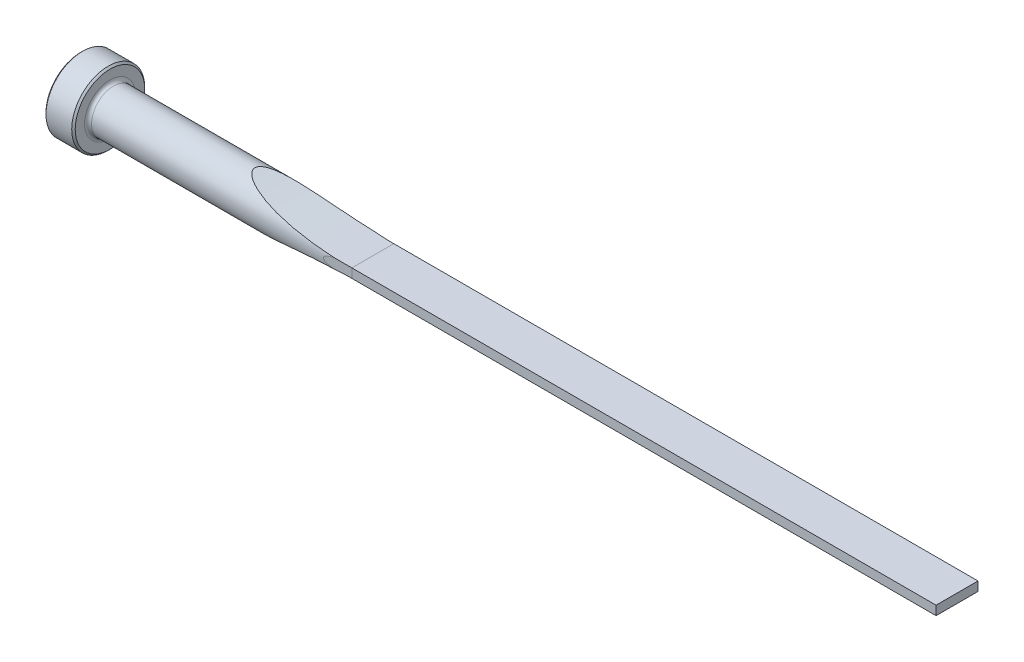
ISO-10303-21;
HEADER;
FILE_DESCRIPTION(('STEP AP214'),'2;1');
FILE_NAME('part.step','',(''),(''),'','','');
FILE_SCHEMA(('AUTOMOTIVE_DESIGN { 1 0 10303 214 1 1 1 1 }'));
ENDSEC;
DATA;
#1=APPLICATION_CONTEXT('core data for automotive mechanical design processes');
#2=APPLICATION_PROTOCOL_DEFINITION('international standard','automotive_design',2000,#1);
#3=PRODUCT_CONTEXT('',#1,'mechanical');
#4=PRODUCT('Part','Part','',(#3));
#5=PRODUCT_RELATED_PRODUCT_CATEGORY('part','',(#4));
#6=PRODUCT_DEFINITION_FORMATION('','',#4);
#7=PRODUCT_DEFINITION_CONTEXT('part definition',#1,'design');
#8=PRODUCT_DEFINITION('design','',#6,#7);
#9=PRODUCT_DEFINITION_SHAPE('','',#8);
#10=(LENGTH_UNIT() NAMED_UNIT(*) SI_UNIT(.MILLI.,.METRE.));
#11=(NAMED_UNIT(*) PLANE_ANGLE_UNIT() SI_UNIT($,.RADIAN.));
#12=(NAMED_UNIT(*) SI_UNIT($,.STERADIAN.) SOLID_ANGLE_UNIT());
#13=UNCERTAINTY_MEASURE_WITH_UNIT(LENGTH_MEASURE(1.E-05),#10,'distance_accuracy_value','');
#14=(GEOMETRIC_REPRESENTATION_CONTEXT(3) GLOBAL_UNCERTAINTY_ASSIGNED_CONTEXT((#13)) GLOBAL_UNIT_ASSIGNED_CONTEXT((#10,
#11,#12)) REPRESENTATION_CONTEXT('',''));
#15=CARTESIAN_POINT('',(0.,0.,0.));
#16=DIRECTION('',(0.,0.,1.));
#17=DIRECTION('',(1.,0.,0.));
#18=AXIS2_PLACEMENT_3D('',#15,#16,#17);
#19=CARTESIAN_POINT('',(0.,0.,0.));
#20=DIRECTION('',(-1.,0.,0.));
#21=DIRECTION('',(0.,0.,1.));
#22=AXIS2_PLACEMENT_3D('',#19,#20,#21);
#23=CYLINDRICAL_SURFACE('',#22,4.7625);
#24=CARTESIAN_POINT('',(7.112,0.,0.));
#25=DIRECTION('',(-1.,0.,0.));
#26=DIRECTION('',(0.,0.,1.));
#27=AXIS2_PLACEMENT_3D('',#24,#25,#26);
#28=CIRCLE('',#27,4.7625);
#29=CARTESIAN_POINT('',(7.112,0.,4.7625));
#30=VERTEX_POINT('',#29);
#31=EDGE_CURVE('E153',#30,#30,#28,.F.);
#32=ORIENTED_EDGE('',*,*,#31,.T.);
#33=EDGE_LOOP('',(#32));
#34=FACE_BOUND('',#33,.T.);
#35=CARTESIAN_POINT('',(63.5,1.37629566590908,4.55929999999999));
#36=CARTESIAN_POINT('',(63.300243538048,1.37627017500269,4.5592994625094));
#37=CARTESIAN_POINT('',(63.1004832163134,1.37406392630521,4.55997325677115));
#38=CARTESIAN_POINT('',(62.7010249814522,1.36511039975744,4.56266611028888));
#39=CARTESIAN_POINT('',(62.5013270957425,1.35836200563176,4.56468550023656));
#40=CARTESIAN_POINT('',(62.1003478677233,1.34006170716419,4.57009060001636));
#41=CARTESIAN_POINT('',(61.8990686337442,1.32846669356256,4.57348856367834));
#42=CARTESIAN_POINT('',(61.4969284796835,1.30007175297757,4.58164172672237));
#43=CARTESIAN_POINT('',(61.2960675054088,1.28327254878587,4.58639673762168));
#44=CARTESIAN_POINT('',(60.8961767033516,1.24395343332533,4.59721659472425));
#45=CARTESIAN_POINT('',(60.6971431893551,1.2214691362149,4.60327325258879));
#46=CARTESIAN_POINT('',(60.2999040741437,1.16973426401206,4.6166926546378));
#47=CARTESIAN_POINT('',(60.1016988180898,1.14048110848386,4.62405589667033));
#48=CARTESIAN_POINT('',(59.707485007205,1.07370926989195,4.640013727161));
#49=CARTESIAN_POINT('',(59.5114710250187,1.03622172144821,4.64860363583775));
#50=CARTESIAN_POINT('',(59.1219644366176,0.950234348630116,4.66695416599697));
#51=CARTESIAN_POINT('',(58.9284697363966,0.90174438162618,4.67671373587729));
#52=CARTESIAN_POINT('',(58.689568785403,0.8306098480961,4.68952997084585));
#53=CARTESIAN_POINT('',(58.6417966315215,0.815810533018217,4.69213189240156));
#54=CARTESIAN_POINT('',(58.5466454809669,0.784967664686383,4.69739068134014));
#55=CARTESIAN_POINT('',(58.4992665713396,0.768923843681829,4.70004756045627));
#56=CARTESIAN_POINT('',(58.3571752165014,0.718404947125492,4.70812874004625));
#57=CARTESIAN_POINT('',(58.2632340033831,0.681752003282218,4.71362458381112));
#58=CARTESIAN_POINT('',(58.0775344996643,0.599731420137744,4.72477713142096));
#59=CARTESIAN_POINT('',(57.985820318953,0.554256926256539,4.73043499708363));
#60=CARTESIAN_POINT('',(57.8546141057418,0.47603487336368,4.73871868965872));
#61=CARTESIAN_POINT('',(57.812099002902,0.448424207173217,4.74143547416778));
#62=CARTESIAN_POINT('',(57.7304247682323,0.388667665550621,4.74670987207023));
#63=CARTESIAN_POINT('',(57.6912549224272,0.356537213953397,4.74926798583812));
#64=CARTESIAN_POINT('',(57.634384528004,0.30109449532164,4.75301502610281));
#65=CARTESIAN_POINT('',(57.6146643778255,0.279884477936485,4.75432176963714));
#66=CARTESIAN_POINT('',(57.5781710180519,0.235020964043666,4.75675058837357));
#67=CARTESIAN_POINT('',(57.5613938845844,0.211370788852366,4.75787290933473));
#68=CARTESIAN_POINT('',(57.536135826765,0.168085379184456,4.75956809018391));
#69=CARTESIAN_POINT('',(57.5266352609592,0.149056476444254,4.76020769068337));
#70=CARTESIAN_POINT('',(57.5107840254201,0.109713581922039,4.76127659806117));
#71=CARTESIAN_POINT('',(57.5044294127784,0.0894012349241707,4.76170616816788));
#72=CARTESIAN_POINT('',(57.4955459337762,0.0476995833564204,4.76230708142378));
#73=CARTESIAN_POINT('',(57.4930580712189,0.0263011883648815,4.76247565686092));
#74=CARTESIAN_POINT('',(57.4924127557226,-0.0165581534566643,4.76251936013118));
#75=CARTESIAN_POINT('',(57.4942536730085,-0.038019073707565,4.76239459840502));
#76=CARTESIAN_POINT('',(57.5014223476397,-0.077150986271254,4.76190953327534));
#77=CARTESIAN_POINT('',(57.5062147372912,-0.0949256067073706,4.76158540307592));
#78=CARTESIAN_POINT('',(57.518318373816,-0.129583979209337,4.76076832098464));
#79=CARTESIAN_POINT('',(57.5256312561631,-0.146467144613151,4.76027525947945));
#80=CARTESIAN_POINT('',(57.5478239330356,-0.190109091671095,4.75878258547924));
#81=CARTESIAN_POINT('',(57.5644976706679,-0.215945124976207,4.75766444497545));
#82=CARTESIAN_POINT('',(57.6015159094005,-0.264813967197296,4.75519504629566));
#83=CARTESIAN_POINT('',(57.6218718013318,-0.287837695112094,4.75384306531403));
#84=CARTESIAN_POINT('',(57.6862463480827,-0.353109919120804,4.74959319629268));
#85=CARTESIAN_POINT('',(57.7337556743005,-0.391849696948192,4.7464888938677));
#86=CARTESIAN_POINT('',(57.8332528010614,-0.462955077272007,4.74007706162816));
#87=CARTESIAN_POINT('',(57.8852557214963,-0.495297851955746,4.73676885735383));
#88=CARTESIAN_POINT('',(58.0324605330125,-0.578484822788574,4.72754240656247));
#89=CARTESIAN_POINT('',(58.1303120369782,-0.624585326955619,4.7215611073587));
#90=CARTESIAN_POINT('',(58.3296567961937,-0.708279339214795,4.70972175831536));
#91=CARTESIAN_POINT('',(58.4311588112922,-0.745850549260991,4.70386406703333));
#92=CARTESIAN_POINT('',(58.637175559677,-0.815246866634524,4.69233729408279));
#93=CARTESIAN_POINT('',(58.7417096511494,-0.847014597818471,4.68667050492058));
#94=CARTESIAN_POINT('',(58.9519315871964,-0.905852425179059,4.67565197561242));
#95=CARTESIAN_POINT('',(59.0576177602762,-0.932928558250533,4.67029983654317));
#96=CARTESIAN_POINT('',(59.3472077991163,-1.0018017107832,4.6561580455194));
#97=CARTESIAN_POINT('',(59.5319939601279,-1.0399498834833,4.64770520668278));
#98=CARTESIAN_POINT('',(59.9031150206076,-1.10820041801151,4.63190013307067));
#99=CARTESIAN_POINT('',(60.0894504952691,-1.13829964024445,4.62454832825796));
#100=CARTESIAN_POINT('',(60.4634968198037,-1.19209136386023,4.61097562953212));
#101=CARTESIAN_POINT('',(60.6512097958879,-1.21576959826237,4.60475726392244));
#102=CARTESIAN_POINT('',(61.0272867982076,-1.25764094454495,4.59349611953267));
#103=CARTESIAN_POINT('',(61.2156508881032,-1.27583350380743,4.58845345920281));
#104=CARTESIAN_POINT('',(61.7534776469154,-1.32086317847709,4.57577149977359));
#105=CARTESIAN_POINT('',(62.1034775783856,-1.3418615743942,4.56957976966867));
#106=CARTESIAN_POINT('',(62.6280335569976,-1.36263417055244,4.56340533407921));
#107=CARTESIAN_POINT('',(62.8023917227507,-1.36777128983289,4.56186604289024));
#108=CARTESIAN_POINT('',(63.1511637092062,-1.37459791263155,4.55981341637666));
#109=CARTESIAN_POINT('',(63.3255775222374,-1.37628777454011,4.55929997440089));
#110=CARTESIAN_POINT('',(63.4999999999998,-1.37629566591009,4.55929999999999));
#111=B_SPLINE_CURVE_WITH_KNOTS('',3,(#35,#36,#37,#38,#39,#40,#41,#42,#43,#44,#45,#46,#47,#48,
#49,#50,#51,#52,#53,#54,#55,#56,#57,#58,#59,#60,#61,#62,#63,#64,#65,#66,#67,#68,#69,#70,#71,#72,
#73,#74,#75,#76,#77,#78,#79,#80,#81,#82,#83,#84,#85,#86,#87,#88,#89,#90,#91,#92,#93,#94,#95,#96,
#97,#98,#99,#100,#101,#102,#103,#104,#105,#106,#107,#108,#109,#110),.UNSPECIFIED.,.F.,.F.,(4,2,
2,2,2,2,2,2,2,2,2,2,2,2,2,2,2,2,2,2,2,2,2,2,2,2,2,2,2,2,2,2,2,2,2,2,2,4),(0.,0.599262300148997,
1.19867192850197,1.80353056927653,2.40830524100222,3.00938132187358,3.61068692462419,
4.2097569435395,4.80829234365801,4.95851786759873,5.10877580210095,5.41155733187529,
5.71826557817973,5.87039269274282,6.0220127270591,6.10881533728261,6.19550132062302,
6.25911958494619,6.32265791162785,6.38686552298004,6.45104896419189,6.50606849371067,
6.56112379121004,6.65289509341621,6.74495530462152,6.92807013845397,7.11182707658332,
7.43597686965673,7.76096456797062,8.08900931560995,8.41662876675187,8.98296372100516,
9.54951926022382,10.1173235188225,10.6851849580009,11.7368092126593,12.2601040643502,
12.7833445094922),.UNSPECIFIED.);
#112=CARTESIAN_POINT('',(59.7044690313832,1.0716608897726,4.64036088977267));
#113=VERTEX_POINT('',#112);
#114=CARTESIAN_POINT('',(59.7044690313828,-1.07166088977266,4.64036088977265));
#115=VERTEX_POINT('',#114);
#116=EDGE_CURVE('E156',#113,#115,#111,.T.);
#117=ORIENTED_EDGE('',*,*,#116,.F.);
#118=CARTESIAN_POINT('',(63.5,0.99059999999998,4.65833853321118));
#119=CARTESIAN_POINT('',(63.1029471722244,0.990599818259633,4.65832849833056));
#120=CARTESIAN_POINT('',(62.7058945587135,0.993260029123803,4.65777261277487));
#121=CARTESIAN_POINT('',(61.9118628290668,1.00389985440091,4.65549627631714));
#122=CARTESIAN_POINT('',(61.5148837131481,1.01187948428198,4.65377582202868));
#123=CARTESIAN_POINT('',(60.7210267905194,1.03315804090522,4.64909720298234));
#124=CARTESIAN_POINT('',(60.3241490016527,1.04645760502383,4.64613888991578));
#125=CARTESIAN_POINT('',(59.5306233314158,1.07837262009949,4.63883399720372));
#126=CARTESIAN_POINT('',(59.133975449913,1.09698806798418,4.63448741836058));
#127=CARTESIAN_POINT('',(57.9420256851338,1.16093510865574,4.61904976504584));
#128=CARTESIAN_POINT('',(57.1471666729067,1.21430184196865,4.6055729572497));
#129=CARTESIAN_POINT('',(55.559423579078,1.3423557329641,4.5698903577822));
#130=CARTESIAN_POINT('',(54.7665393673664,1.417041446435,4.54768515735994));
#131=CARTESIAN_POINT('',(53.2238153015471,1.58329126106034,4.49242798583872));
#132=CARTESIAN_POINT('',(52.4738418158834,1.67380073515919,4.45998672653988));
#133=CARTESIAN_POINT('',(51.3513459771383,1.82379135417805,4.3997791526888));
#134=CARTESIAN_POINT('',(50.9775513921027,1.87616568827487,4.37778269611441));
#135=CARTESIAN_POINT('',(50.2309518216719,1.98562465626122,4.32923747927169));
#136=CARTESIAN_POINT('',(49.8581468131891,2.04270917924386,4.30268882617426));
#137=CARTESIAN_POINT('',(49.1139213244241,2.16151329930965,4.24424854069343));
#138=CARTESIAN_POINT('',(48.7425001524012,2.22323011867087,4.21236009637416));
#139=CARTESIAN_POINT('',(48.0010599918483,2.35126953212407,4.14225407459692));
#140=CARTESIAN_POINT('',(47.6310409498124,2.41759194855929,4.10403674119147));
#141=CARTESIAN_POINT('',(46.892815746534,2.5547406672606,4.02009603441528));
#142=CARTESIAN_POINT('',(46.5246090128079,2.6255654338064,3.97437521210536));
#143=CARTESIAN_POINT('',(45.7903150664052,2.77161721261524,3.87393954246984));
#144=CARTESIAN_POINT('',(45.4242276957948,2.84684389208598,3.81922537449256));
#145=CARTESIAN_POINT('',(44.693840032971,3.00171663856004,3.69875073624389));
#146=CARTESIAN_POINT('',(44.3295462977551,3.08137306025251,3.63296358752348));
#147=CARTESIAN_POINT('',(43.6043732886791,3.24469913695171,3.48788156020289));
#148=CARTESIAN_POINT('',(43.2434951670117,3.32837009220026,3.40858228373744));
#149=CARTESIAN_POINT('',(42.7059558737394,3.45651123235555,3.27683661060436));
#150=CARTESIAN_POINT('',(42.5274060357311,3.49966399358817,3.23078867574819));
#151=CARTESIAN_POINT('',(42.1718343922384,3.58675976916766,3.13381840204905));
#152=CARTESIAN_POINT('',(41.9948124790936,3.63070272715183,3.08289640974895));
#153=CARTESIAN_POINT('',(41.6427504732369,3.71923835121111,2.9754854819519));
#154=CARTESIAN_POINT('',(41.4677091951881,3.76383058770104,2.91900009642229));
#155=CARTESIAN_POINT('',(41.1200080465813,3.85352553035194,2.79952338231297));
#156=CARTESIAN_POINT('',(40.9473478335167,3.89862816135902,2.73653300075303));
#157=CARTESIAN_POINT('',(40.6040909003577,3.9893832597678,2.60246513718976));
#158=CARTESIAN_POINT('',(40.4335120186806,4.0350373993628,2.53134275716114));
#159=CARTESIAN_POINT('',(40.096411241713,4.12631535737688,2.37965980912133));
#160=CARTESIAN_POINT('',(39.9298918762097,4.17193914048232,2.29909352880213));
#161=CARTESIAN_POINT('',(39.6027058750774,4.26257800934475,2.12634943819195));
#162=CARTESIAN_POINT('',(39.4420404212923,4.30759297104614,2.03416929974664));
#163=CARTESIAN_POINT('',(39.1296029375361,4.39603902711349,1.83525118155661));
#164=CARTESIAN_POINT('',(38.9778181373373,4.43947236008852,1.72853487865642));
#165=CARTESIAN_POINT('',(38.759696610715,4.50246697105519,1.55340678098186));
#166=CARTESIAN_POINT('',(38.688110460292,4.52324507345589,1.49203286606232));
#167=CARTESIAN_POINT('',(38.5497684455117,4.56357510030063,1.36371995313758));
#168=CARTESIAN_POINT('',(38.4830154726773,4.58312628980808,1.29677767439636));
#169=CARTESIAN_POINT('',(38.2932292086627,4.63893943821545,1.08738620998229));
#170=CARTESIAN_POINT('',(38.1790982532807,4.67281620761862,0.935192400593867));
#171=CARTESIAN_POINT('',(38.0476008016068,4.71203882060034,0.695441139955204));
#172=CARTESIAN_POINT('',(38.0116979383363,4.72278057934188,0.618934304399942));
#173=CARTESIAN_POINT('',(37.9515599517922,4.74080155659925,0.460990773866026));
#174=CARTESIAN_POINT('',(37.9273183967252,4.74808268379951,0.379556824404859));
#175=CARTESIAN_POINT('',(37.8927159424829,4.75848292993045,0.212756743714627));
#176=CARTESIAN_POINT('',(37.8824693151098,4.76156778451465,0.127364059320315));
#177=CARTESIAN_POINT('',(37.87748902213,4.76306661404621,-0.0439100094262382));
#178=CARTESIAN_POINT('',(37.8827506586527,4.76148200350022,-0.129791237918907));
#179=CARTESIAN_POINT('',(37.9069880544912,4.75419258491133,-0.291649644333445));
#180=CARTESIAN_POINT('',(37.9247267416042,4.74885946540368,-0.367837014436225));
#181=CARTESIAN_POINT('',(37.9709294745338,4.73499455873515,-0.516548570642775));
#182=CARTESIAN_POINT('',(37.999400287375,4.7264607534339,-0.58907041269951));
#183=CARTESIAN_POINT('',(38.0834016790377,4.70134396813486,-0.768755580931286));
#184=CARTESIAN_POINT('',(38.1451725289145,4.68292488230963,-0.872724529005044));
#185=CARTESIAN_POINT('',(38.2833081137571,4.64194220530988,-1.06956257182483));
#186=CARTESIAN_POINT('',(38.3597162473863,4.61936629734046,-1.16239728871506));
#187=CARTESIAN_POINT('',(38.5157382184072,4.57352818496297,-1.3308686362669));
#188=CARTESIAN_POINT('',(38.5945805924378,4.55047261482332,-1.40729062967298));
#189=CARTESIAN_POINT('',(38.7583123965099,4.50285981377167,-1.5529115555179));
#190=CARTESIAN_POINT('',(38.8432072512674,4.4783012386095,-1.62210386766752));
#191=CARTESIAN_POINT('',(39.0175838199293,4.42815473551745,-1.75438350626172));
#192=CARTESIAN_POINT('',(39.107074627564,4.40256479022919,-1.81745795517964));
#193=CARTESIAN_POINT('',(39.2893760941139,4.35075737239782,-1.93820126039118));
#194=CARTESIAN_POINT('',(39.3821855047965,4.32454013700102,-1.9958721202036));
#195=CARTESIAN_POINT('',(39.6196852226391,4.25788012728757,-2.13556036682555));
#196=CARTESIAN_POINT('',(39.7660990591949,4.2171756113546,-2.21451714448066));
#197=CARTESIAN_POINT('',(40.0632531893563,4.13540953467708,-2.36368625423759));
#198=CARTESIAN_POINT('',(40.2139956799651,4.09434780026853,-2.43389404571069));
#199=CARTESIAN_POINT('',(40.5189268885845,4.01216697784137,-2.56711016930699));
#200=CARTESIAN_POINT('',(40.673121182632,3.9710479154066,-2.63010567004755));
#201=CARTESIAN_POINT('',(40.9839744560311,3.88906255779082,-2.74988395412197));
#202=CARTESIAN_POINT('',(41.1406337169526,3.84819629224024,-2.80666602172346));
#203=CARTESIAN_POINT('',(41.4567086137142,3.76667717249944,-2.91516298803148));
#204=CARTESIAN_POINT('',(41.6161343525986,3.72602653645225,-2.96684997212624));
#205=CARTESIAN_POINT('',(41.9365715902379,3.64527630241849,-3.06552265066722));
#206=CARTESIAN_POINT('',(42.0975831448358,3.60517672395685,-3.11250817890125));
#207=CARTESIAN_POINT('',(42.4207194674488,3.52566739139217,-3.20229088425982));
#208=CARTESIAN_POINT('',(42.5828427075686,3.48625688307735,-3.245092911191));
#209=CARTESIAN_POINT('',(42.9081758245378,3.40814646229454,-3.32703212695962));
#210=CARTESIAN_POINT('',(43.0713856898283,3.36944654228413,-3.36616935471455));
#211=CARTESIAN_POINT('',(43.5400784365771,3.2597185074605,-3.47356496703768));
#212=CARTESIAN_POINT('',(43.8467111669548,3.1896329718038,-3.53778518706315));
#213=CARTESIAN_POINT('',(44.4624456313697,3.05235344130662,-3.65688163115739));
#214=CARTESIAN_POINT('',(44.7715477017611,2.98515984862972,-3.71175655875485));
#215=CARTESIAN_POINT('',(45.3918230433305,2.85380047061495,-3.81367813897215));
#216=CARTESIAN_POINT('',(45.7029971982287,2.78963608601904,-3.8607211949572));
#217=CARTESIAN_POINT('',(46.3269246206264,2.66447585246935,-3.9481383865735));
#218=CARTESIAN_POINT('',(46.6396779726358,2.60348017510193,-3.98851216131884));
#219=CARTESIAN_POINT('',(47.2671688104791,2.48460831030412,-4.06362920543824));
#220=CARTESIAN_POINT('',(47.5819091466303,2.42673927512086,-4.0983599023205));
#221=CARTESIAN_POINT('',(48.2124912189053,2.31432089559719,-4.16287326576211));
#222=CARTESIAN_POINT('',(48.5283329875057,2.2597716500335,-4.19265578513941));
#223=CARTESIAN_POINT('',(49.4770807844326,2.10119972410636,-4.27558958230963));
#224=CARTESIAN_POINT('',(50.1113976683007,2.00221715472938,-4.32234877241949));
#225=CARTESIAN_POINT('',(51.3827800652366,1.81792740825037,-4.40302345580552));
#226=CARTESIAN_POINT('',(52.0198455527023,1.73262010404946,-4.43693906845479));
#227=CARTESIAN_POINT('',(53.2961472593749,1.5757949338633,-4.49502683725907));
#228=CARTESIAN_POINT('',(53.9353836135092,1.50427794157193,-4.51919837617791));
#229=CARTESIAN_POINT('',(55.2147568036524,1.37519082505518,-4.56013445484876));
#230=CARTESIAN_POINT('',(55.8548917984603,1.31760498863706,-4.57690735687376));
#231=CARTESIAN_POINT('',(57.1363484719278,1.2163252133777,-4.60485841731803));
#232=CARTESIAN_POINT('',(57.7776700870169,1.17263055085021,-4.61603686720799));
#233=CARTESIAN_POINT('',(58.8429483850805,1.11165061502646,-4.63100940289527));
#234=CARTESIAN_POINT('',(59.2666682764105,1.09043731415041,-4.63602193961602));
#235=CARTESIAN_POINT('',(60.1144308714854,1.05407630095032,-4.64442451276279));
#236=CARTESIAN_POINT('',(60.5384736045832,1.03892922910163,-4.64781437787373));
#237=CARTESIAN_POINT('',(61.3854083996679,1.01474609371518,-4.65315560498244));
#238=CARTESIAN_POINT('',(61.8082998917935,1.00569098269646,-4.65511145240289));
#239=CARTESIAN_POINT('',(62.654127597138,0.993618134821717,-4.65769629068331));
#240=CARTESIAN_POINT('',(63.0770638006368,0.99059974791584,-4.65832542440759));
#241=CARTESIAN_POINT('',(63.5,0.990599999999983,-4.65833853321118));
#242=B_SPLINE_CURVE_WITH_KNOTS('',3,(#118,#119,#120,#121,#122,#123,#124,#125,#126,#127,#128,
#129,#130,#131,#132,#133,#134,#135,#136,#137,#138,#139,#140,#141,#142,#143,#144,#145,#146,#147,
#148,#149,#150,#151,#152,#153,#154,#155,#156,#157,#158,#159,#160,#161,#162,#163,#164,#165,#166,
#167,#168,#169,#170,#171,#172,#173,#174,#175,#176,#177,#178,#179,#180,#181,#182,#183,#184,#185,
#186,#187,#188,#189,#190,#191,#192,#193,#194,#195,#196,#197,#198,#199,#200,#201,#202,#203,#204,
#205,#206,#207,#208,#209,#210,#211,#212,#213,#214,#215,#216,#217,#218,#219,#220,#221,#222,#223,
#224,#225,#226,#227,#228,#229,#230,#231,#232,#233,#234,#235,#236,#237,#238,#239,#240,#241),
.UNSPECIFIED.,.F.,.F.,(4,2,2,2,2,2,2,2,2,2,2,2,2,2,2,2,2,2,2,2,2,2,2,2,2,2,2,2,2,2,2,2,2,2,2,2,
2,2,2,2,2,2,2,2,2,2,2,2,2,2,2,2,2,2,2,2,2,2,2,2,2,4),(0.,1.19114867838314,2.38230082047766,
3.57359571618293,4.76488992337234,7.15482549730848,9.5445992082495,11.8125362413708,
12.9467485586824,14.0809341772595,15.2144450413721,16.3479122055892,17.4809948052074,
18.6139918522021,19.7497587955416,20.8858961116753,21.4539629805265,22.0219894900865,
22.5896558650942,23.157239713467,23.7281241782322,24.2993557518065,24.8707020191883,
25.4412054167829,25.7305810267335,26.0201283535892,26.5932280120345,26.8480141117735,
27.1026595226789,27.359371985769,27.6160066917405,27.8502419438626,28.084625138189,
28.449508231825,28.8154904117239,29.1515825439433,29.487979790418,29.8250704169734,
30.1620355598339,30.6754130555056,31.1890558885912,31.7035987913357,32.2182009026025,
32.7354816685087,33.2527807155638,33.7694727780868,34.2861593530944,35.2490357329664,
36.2120455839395,37.1754964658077,38.1389994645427,39.1046205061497,40.0702702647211,
42.000991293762,43.9316943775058,45.8625197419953,47.7911571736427,49.7196941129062,
50.9924924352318,52.2654251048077,53.5343590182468,54.8031562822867),.UNSPECIFIED.);
#243=CARTESIAN_POINT('',(59.7044690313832,1.0716608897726,-4.64036088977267));
#244=VERTEX_POINT('',#243);
#245=EDGE_CURVE('E106',#113,#244,#242,.T.);
#246=ORIENTED_EDGE('',*,*,#245,.T.);
#247=CARTESIAN_POINT('',(63.5,1.37629566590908,-4.55929999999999));
#248=CARTESIAN_POINT('',(63.3002435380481,1.37627017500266,-4.55929946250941));
#249=CARTESIAN_POINT('',(63.1004832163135,1.37406392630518,-4.55997325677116));
#250=CARTESIAN_POINT('',(62.7010249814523,1.36511039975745,-4.56266611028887));
#251=CARTESIAN_POINT('',(62.5013270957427,1.3583620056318,-4.56468550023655));
#252=CARTESIAN_POINT('',(62.1003478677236,1.34006170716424,-4.57009060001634));
#253=CARTESIAN_POINT('',(61.8990686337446,1.32846669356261,-4.57348856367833));
#254=CARTESIAN_POINT('',(61.4969284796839,1.3000717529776,-4.58164172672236));
#255=CARTESIAN_POINT('',(61.2960675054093,1.2832725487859,-4.58639673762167));
#256=CARTESIAN_POINT('',(60.8961767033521,1.24395343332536,-4.59721659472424));
#257=CARTESIAN_POINT('',(60.6971431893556,1.22146913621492,-4.60327325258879));
#258=CARTESIAN_POINT('',(60.299904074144,1.16973426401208,-4.6166926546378));
#259=CARTESIAN_POINT('',(60.1016988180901,1.14048110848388,-4.62405589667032));
#260=CARTESIAN_POINT('',(59.7074850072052,1.07370926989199,-4.64001372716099));
#261=CARTESIAN_POINT('',(59.5114710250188,1.03622172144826,-4.64860363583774));
#262=CARTESIAN_POINT('',(59.1219644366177,0.950234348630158,-4.66695416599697));
#263=CARTESIAN_POINT('',(58.9284697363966,0.901744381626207,-4.67671373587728));
#264=CARTESIAN_POINT('',(58.689568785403,0.830609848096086,-4.68952997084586));
#265=CARTESIAN_POINT('',(58.6417966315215,0.815810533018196,-4.69213189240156));
#266=CARTESIAN_POINT('',(58.5466454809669,0.784967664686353,-4.69739068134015));
#267=CARTESIAN_POINT('',(58.4992665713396,0.768923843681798,-4.70004756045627));
#268=CARTESIAN_POINT('',(58.3571752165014,0.718404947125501,-4.70812874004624));
#269=CARTESIAN_POINT('',(58.263234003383,0.681752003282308,-4.7136245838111));
#270=CARTESIAN_POINT('',(58.0775344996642,0.599731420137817,-4.72477713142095));
#271=CARTESIAN_POINT('',(57.985820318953,0.554256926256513,-4.73043499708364));
#272=CARTESIAN_POINT('',(57.8546141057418,0.476034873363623,-4.73871868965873));
#273=CARTESIAN_POINT('',(57.812099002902,0.448424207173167,-4.74143547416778));
#274=CARTESIAN_POINT('',(57.7304247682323,0.388667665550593,-4.74670987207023));
#275=CARTESIAN_POINT('',(57.6912549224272,0.356537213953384,-4.74926798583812));
#276=CARTESIAN_POINT('',(57.634384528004,0.301094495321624,-4.75301502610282));
#277=CARTESIAN_POINT('',(57.6146643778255,0.279884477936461,-4.75432176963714));
#278=CARTESIAN_POINT('',(57.5781710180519,0.235020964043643,-4.75675058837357));
#279=CARTESIAN_POINT('',(57.5613938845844,0.211370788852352,-4.75787290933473));
#280=CARTESIAN_POINT('',(57.536135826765,0.168085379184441,-4.75956809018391));
#281=CARTESIAN_POINT('',(57.5266352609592,0.149056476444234,-4.76020769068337));
#282=CARTESIAN_POINT('',(57.5107840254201,0.109713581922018,-4.76127659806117));
#283=CARTESIAN_POINT('',(57.5044294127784,0.0894012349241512,-4.76170616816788));
#284=CARTESIAN_POINT('',(57.4955459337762,0.0476995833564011,-4.76230708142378));
#285=CARTESIAN_POINT('',(57.4930580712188,0.0263011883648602,-4.76247565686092));
#286=CARTESIAN_POINT('',(57.4924127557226,-0.0165581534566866,-4.76251936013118));
#287=CARTESIAN_POINT('',(57.4942536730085,-0.0380190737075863,-4.76239459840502));
#288=CARTESIAN_POINT('',(57.5014223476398,-0.0771509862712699,-4.76190953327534));
#289=CARTESIAN_POINT('',(57.5062147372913,-0.0949256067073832,-4.76158540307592));
#290=CARTESIAN_POINT('',(57.5183183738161,-0.129583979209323,-4.76076832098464));
#291=CARTESIAN_POINT('',(57.5256312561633,-0.146467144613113,-4.76027525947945));
#292=CARTESIAN_POINT('',(57.5478239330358,-0.190109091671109,-4.75878258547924));
#293=CARTESIAN_POINT('',(57.5644976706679,-0.215945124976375,-4.75766444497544));
#294=CARTESIAN_POINT('',(57.6015159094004,-0.264813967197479,-4.75519504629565));
#295=CARTESIAN_POINT('',(57.6218718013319,-0.287837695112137,-4.75384306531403));
#296=CARTESIAN_POINT('',(57.686246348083,-0.353109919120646,-4.74959319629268));
#297=CARTESIAN_POINT('',(57.7337556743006,-0.391849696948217,-4.74648889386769));
#298=CARTESIAN_POINT('',(57.8332528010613,-0.462955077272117,-4.74007706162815));
#299=CARTESIAN_POINT('',(57.8852557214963,-0.495297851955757,-4.73676885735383));
#300=CARTESIAN_POINT('',(58.0324605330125,-0.578484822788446,-4.72754240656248));
#301=CARTESIAN_POINT('',(58.1303120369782,-0.624585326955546,-4.72156110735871));
#302=CARTESIAN_POINT('',(58.3296567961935,-0.708279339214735,-4.70972175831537));
#303=CARTESIAN_POINT('',(58.431158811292,-0.74585054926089,-4.70386406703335));
#304=CARTESIAN_POINT('',(58.6371755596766,-0.815246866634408,-4.69233729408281));
#305=CARTESIAN_POINT('',(58.741709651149,-0.847014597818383,-4.6866705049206));
#306=CARTESIAN_POINT('',(58.9519315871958,-0.90585242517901,-4.67565197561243));
#307=CARTESIAN_POINT('',(59.0576177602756,-0.932928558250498,-4.67029983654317));
#308=CARTESIAN_POINT('',(59.3472077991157,-1.00180171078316,-4.65615804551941));
#309=CARTESIAN_POINT('',(59.5319939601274,-1.03994988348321,-4.6477052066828));
#310=CARTESIAN_POINT('',(59.9031150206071,-1.10820041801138,-4.63190013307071));
#311=CARTESIAN_POINT('',(60.0894504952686,-1.13829964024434,-4.62454832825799));
#312=CARTESIAN_POINT('',(60.4634968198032,-1.19209136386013,-4.61097562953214));
#313=CARTESIAN_POINT('',(60.6512097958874,-1.21576959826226,-4.60475726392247));
#314=CARTESIAN_POINT('',(61.0272867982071,-1.25764094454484,-4.5934961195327));
#315=CARTESIAN_POINT('',(61.2156508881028,-1.27583350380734,-4.58845345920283));
#316=CARTESIAN_POINT('',(61.753477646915,-1.32086317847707,-4.5757714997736));
#317=CARTESIAN_POINT('',(62.1034775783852,-1.34186157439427,-4.56957976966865));
#318=CARTESIAN_POINT('',(62.6280335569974,-1.36263417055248,-4.5634053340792));
#319=CARTESIAN_POINT('',(62.8023917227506,-1.36777128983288,-4.56186604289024));
#320=CARTESIAN_POINT('',(63.1511637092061,-1.3745979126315,-4.55981341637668));
#321=CARTESIAN_POINT('',(63.3255775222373,-1.37628777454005,-4.5592999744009));
#322=CARTESIAN_POINT('',(63.4999999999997,-1.3762956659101,-4.55929999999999));
#323=B_SPLINE_CURVE_WITH_KNOTS('',3,(#247,#248,#249,#250,#251,#252,#253,#254,#255,#256,#257,
#258,#259,#260,#261,#262,#263,#264,#265,#266,#267,#268,#269,#270,#271,#272,#273,#274,#275,#276,
#277,#278,#279,#280,#281,#282,#283,#284,#285,#286,#287,#288,#289,#290,#291,#292,#293,#294,#295,
#296,#297,#298,#299,#300,#301,#302,#303,#304,#305,#306,#307,#308,#309,#310,#311,#312,#313,#314,
#315,#316,#317,#318,#319,#320,#321,#322),.UNSPECIFIED.,.F.,.F.,(4,2,2,2,2,2,2,2,2,2,2,2,2,2,2,2,
2,2,2,2,2,2,2,2,2,2,2,2,2,2,2,2,2,2,2,2,2,4),(0.,0.599262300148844,1.19867192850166,
1.80353056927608,2.40830524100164,3.00938132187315,3.61068692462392,4.20975694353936,
4.80829234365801,4.95851786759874,5.10877580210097,5.41155733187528,5.71826557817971,
5.87039269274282,6.0220127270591,6.10881533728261,6.19550132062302,6.25911958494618,
6.32265791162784,6.38686552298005,6.45104896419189,6.50606849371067,6.56112379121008,
6.65289509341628,6.7449553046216,6.92807013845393,7.1118270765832,7.43597686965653,
7.76096456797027,8.08900931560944,8.41662876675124,8.98296372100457,9.54951926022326,
10.1173235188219,10.6851849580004,11.7368092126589,12.26010406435,12.7833445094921),.UNSPECIFIED.);
#324=CARTESIAN_POINT('',(59.7044690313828,-1.07166088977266,-4.64036088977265));
#325=VERTEX_POINT('',#324);
#326=EDGE_CURVE('E175',#244,#325,#323,.T.);
#327=ORIENTED_EDGE('',*,*,#326,.T.);
#328=CARTESIAN_POINT('',(63.5,-0.99059999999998,4.65833853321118));
#329=CARTESIAN_POINT('',(63.1029471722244,-0.990599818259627,4.65832849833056));
#330=CARTESIAN_POINT('',(62.7058945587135,-0.993260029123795,4.65777261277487));
#331=CARTESIAN_POINT('',(61.9118628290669,-1.0038998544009,4.65549627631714));
#332=CARTESIAN_POINT('',(61.5148837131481,-1.01187948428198,4.65377582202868));
#333=CARTESIAN_POINT('',(60.7210267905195,-1.03315804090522,4.64909720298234));
#334=CARTESIAN_POINT('',(60.3241490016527,-1.04645760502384,4.64613888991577));
#335=CARTESIAN_POINT('',(59.5306233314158,-1.07837262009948,4.63883399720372));
#336=CARTESIAN_POINT('',(59.133975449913,-1.09698806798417,4.63448741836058));
#337=CARTESIAN_POINT('',(57.9420256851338,-1.16093510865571,4.61904976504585));
#338=CARTESIAN_POINT('',(57.1471666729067,-1.21430184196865,4.6055729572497));
#339=CARTESIAN_POINT('',(55.5594235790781,-1.34235573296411,4.5698903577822));
#340=CARTESIAN_POINT('',(54.7665393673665,-1.417041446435,4.54768515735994));
#341=CARTESIAN_POINT('',(53.2238153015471,-1.58329126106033,4.49242798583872));
#342=CARTESIAN_POINT('',(52.4738418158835,-1.6738007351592,4.45998672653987));
#343=CARTESIAN_POINT('',(51.3513459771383,-1.82379135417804,4.3997791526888));
#344=CARTESIAN_POINT('',(50.9775513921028,-1.87616568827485,4.37778269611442));
#345=CARTESIAN_POINT('',(50.230951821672,-1.98562465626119,4.3292374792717));
#346=CARTESIAN_POINT('',(49.8581468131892,-2.04270917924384,4.30268882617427));
#347=CARTESIAN_POINT('',(49.1139213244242,-2.16151329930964,4.24424854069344));
#348=CARTESIAN_POINT('',(48.7425001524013,-2.22323011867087,4.21236009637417));
#349=CARTESIAN_POINT('',(48.0010599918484,-2.35126953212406,4.14225407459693));
#350=CARTESIAN_POINT('',(47.6310409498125,-2.41759194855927,4.10403674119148));
#351=CARTESIAN_POINT('',(46.892815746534,-2.55474066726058,4.02009603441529));
#352=CARTESIAN_POINT('',(46.5246090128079,-2.62556543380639,3.97437521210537));
#353=CARTESIAN_POINT('',(45.7903150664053,-2.77161721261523,3.87393954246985));
#354=CARTESIAN_POINT('',(45.4242276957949,-2.84684389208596,3.81922537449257));
#355=CARTESIAN_POINT('',(44.693840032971,-3.00171663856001,3.69875073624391));
#356=CARTESIAN_POINT('',(44.3295462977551,-3.08137306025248,3.6329635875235));
#357=CARTESIAN_POINT('',(43.6043732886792,-3.2446991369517,3.48788156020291));
#358=CARTESIAN_POINT('',(43.2434951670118,-3.32837009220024,3.40858228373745));
#359=CARTESIAN_POINT('',(42.7059558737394,-3.45651123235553,3.27683661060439));
#360=CARTESIAN_POINT('',(42.5274060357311,-3.49966399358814,3.23078867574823));
#361=CARTESIAN_POINT('',(42.1718343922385,-3.58675976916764,3.13381840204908));
#362=CARTESIAN_POINT('',(41.9948124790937,-3.63070272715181,3.08289640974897));
#363=CARTESIAN_POINT('',(41.6427504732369,-3.7192383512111,2.97548548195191));
#364=CARTESIAN_POINT('',(41.4677091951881,-3.76383058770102,2.91900009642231));
#365=CARTESIAN_POINT('',(41.1200080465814,-3.85352553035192,2.799523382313));
#366=CARTESIAN_POINT('',(40.9473478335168,-3.89862816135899,2.73653300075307));
#367=CARTESIAN_POINT('',(40.6040909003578,-3.98938325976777,2.60246513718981));
#368=CARTESIAN_POINT('',(40.4335120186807,-4.03503739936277,2.53134275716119));
#369=CARTESIAN_POINT('',(40.0964112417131,-4.12631535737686,2.37965980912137));
#370=CARTESIAN_POINT('',(39.9298918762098,-4.1719391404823,2.29909352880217));
#371=CARTESIAN_POINT('',(39.6027058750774,-4.26257800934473,2.12634943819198));
#372=CARTESIAN_POINT('',(39.4420404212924,-4.30759297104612,2.03416929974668));
#373=CARTESIAN_POINT('',(39.1296029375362,-4.39603902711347,1.83525118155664));
#374=CARTESIAN_POINT('',(38.9778181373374,-4.43947236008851,1.72853487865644));
#375=CARTESIAN_POINT('',(38.759696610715,-4.50246697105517,1.55340678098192));
#376=CARTESIAN_POINT('',(38.6881104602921,-4.52324507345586,1.4920328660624));
#377=CARTESIAN_POINT('',(38.5497684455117,-4.5635751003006,1.36371995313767));
#378=CARTESIAN_POINT('',(38.4830154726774,-4.58312628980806,1.29677767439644));
#379=CARTESIAN_POINT('',(38.2932292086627,-4.63893943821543,1.08738620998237));
#380=CARTESIAN_POINT('',(38.1790982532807,-4.6728162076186,0.935192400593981));
#381=CARTESIAN_POINT('',(38.0476008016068,-4.71203882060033,0.695441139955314));
#382=CARTESIAN_POINT('',(38.0116979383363,-4.72278057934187,0.618934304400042));
#383=CARTESIAN_POINT('',(37.9515599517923,-4.74080155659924,0.460990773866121));
#384=CARTESIAN_POINT('',(37.9273183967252,-4.7480826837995,0.379556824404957));
#385=CARTESIAN_POINT('',(37.8927159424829,-4.75848292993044,0.212756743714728));
#386=CARTESIAN_POINT('',(37.8824693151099,-4.76156778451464,0.127364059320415));
#387=CARTESIAN_POINT('',(37.87748902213,-4.76306661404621,-0.0439100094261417));
#388=CARTESIAN_POINT('',(37.8827506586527,-4.76148200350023,-0.129791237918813));
#389=CARTESIAN_POINT('',(37.9069880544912,-4.75419258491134,-0.291649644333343));
#390=CARTESIAN_POINT('',(37.9247267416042,-4.74885946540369,-0.367837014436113));
#391=CARTESIAN_POINT('',(37.9709294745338,-4.73499455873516,-0.51654857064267));
#392=CARTESIAN_POINT('',(37.999400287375,-4.72646075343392,-0.589070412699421));
#393=CARTESIAN_POINT('',(38.0834016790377,-4.70134396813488,-0.7687555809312));
#394=CARTESIAN_POINT('',(38.1451725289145,-4.68292488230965,-0.87272452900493));
#395=CARTESIAN_POINT('',(38.283308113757,-4.64194220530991,-1.06956257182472));
#396=CARTESIAN_POINT('',(38.3597162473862,-4.61936629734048,-1.16239728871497));
#397=CARTESIAN_POINT('',(38.5157382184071,-4.573528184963,-1.33086863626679));
#398=CARTESIAN_POINT('',(38.5945805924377,-4.55047261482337,-1.40729062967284));
#399=CARTESIAN_POINT('',(38.7583123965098,-4.50285981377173,-1.55291155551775));
#400=CARTESIAN_POINT('',(38.8432072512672,-4.47830123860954,-1.6221038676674));
#401=CARTESIAN_POINT('',(39.0175838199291,-4.4281547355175,-1.75438350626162));
#402=CARTESIAN_POINT('',(39.1070746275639,-4.40256479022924,-1.81745795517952));
#403=CARTESIAN_POINT('',(39.2893760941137,-4.35075737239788,-1.93820126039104));
#404=CARTESIAN_POINT('',(39.3821855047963,-4.32454013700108,-1.99587212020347));
#405=CARTESIAN_POINT('',(39.6196852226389,-4.25788012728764,-2.13556036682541));
#406=CARTESIAN_POINT('',(39.7660990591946,-4.21717561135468,-2.21451714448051));
#407=CARTESIAN_POINT('',(40.063253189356,-4.13540953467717,-2.36368625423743));
#408=CARTESIAN_POINT('',(40.2139956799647,-4.09434780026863,-2.43389404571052));
#409=CARTESIAN_POINT('',(40.5189268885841,-4.01216697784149,-2.56711016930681));
#410=CARTESIAN_POINT('',(40.6731211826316,-3.97104791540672,-2.63010567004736));
#411=CARTESIAN_POINT('',(40.9839744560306,-3.88906255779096,-2.74988395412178));
#412=CARTESIAN_POINT('',(41.1406337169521,-3.84819629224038,-2.80666602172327));
#413=CARTESIAN_POINT('',(41.4567086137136,-3.76667717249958,-2.91516298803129));
#414=CARTESIAN_POINT('',(41.616134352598,-3.7260265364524,-2.96684997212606));
#415=CARTESIAN_POINT('',(41.9365715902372,-3.64527630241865,-3.06552265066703));
#416=CARTESIAN_POINT('',(42.0975831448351,-3.60517672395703,-3.11250817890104));
#417=CARTESIAN_POINT('',(42.4207194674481,-3.52566739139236,-3.20229088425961));
#418=CARTESIAN_POINT('',(42.5828427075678,-3.48625688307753,-3.2450929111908));
#419=CARTESIAN_POINT('',(42.9081758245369,-3.40814646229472,-3.32703212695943));
#420=CARTESIAN_POINT('',(43.0713856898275,-3.36944654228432,-3.36616935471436));
#421=CARTESIAN_POINT('',(43.5400784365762,-3.25971850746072,-3.47356496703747));
#422=CARTESIAN_POINT('',(43.8467111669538,-3.18963297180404,-3.53778518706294));
#423=CARTESIAN_POINT('',(44.4624456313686,-3.05235344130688,-3.65688163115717));
#424=CARTESIAN_POINT('',(44.7715477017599,-2.98515984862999,-3.71175655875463));
#425=CARTESIAN_POINT('',(45.3918230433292,-2.85380047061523,-3.81367813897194));
#426=CARTESIAN_POINT('',(45.7029971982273,-2.78963608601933,-3.86072119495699));
#427=CARTESIAN_POINT('',(46.3269246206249,-2.66447585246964,-3.9481383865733));
#428=CARTESIAN_POINT('',(46.6396779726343,-2.60348017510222,-3.98851216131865));
#429=CARTESIAN_POINT('',(47.2671688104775,-2.48460831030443,-4.06362920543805));
#430=CARTESIAN_POINT('',(47.5819091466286,-2.42673927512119,-4.09835990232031));
#431=CARTESIAN_POINT('',(48.2124912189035,-2.31432089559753,-4.16287326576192));
#432=CARTESIAN_POINT('',(48.5283329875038,-2.25977165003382,-4.19265578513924));
#433=CARTESIAN_POINT('',(49.4770807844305,-2.10119972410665,-4.27558958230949));
#434=CARTESIAN_POINT('',(50.1113976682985,-2.0022171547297,-4.32234877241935));
#435=CARTESIAN_POINT('',(51.3827800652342,-1.81792740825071,-4.40302345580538));
#436=CARTESIAN_POINT('',(52.0198455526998,-1.73262010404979,-4.43693906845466));
#437=CARTESIAN_POINT('',(53.2961472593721,-1.57579493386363,-4.49502683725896));
#438=CARTESIAN_POINT('',(53.9353836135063,-1.50427794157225,-4.5191983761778));
#439=CARTESIAN_POINT('',(55.2147568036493,-1.37519082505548,-4.56013445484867));
#440=CARTESIAN_POINT('',(55.8548917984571,-1.31760498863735,-4.57690735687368));
#441=CARTESIAN_POINT('',(57.1363484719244,-1.21632521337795,-4.60485841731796));
#442=CARTESIAN_POINT('',(57.7776700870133,-1.17263055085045,-4.61603686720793));
#443=CARTESIAN_POINT('',(58.8429483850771,-1.11165061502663,-4.63100940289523));
#444=CARTESIAN_POINT('',(59.2666682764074,-1.09043731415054,-4.63602193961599));
#445=CARTESIAN_POINT('',(60.1144308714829,-1.0540763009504,-4.64442451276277));
#446=CARTESIAN_POINT('',(60.538473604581,-1.0389292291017,-4.64781437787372));
#447=CARTESIAN_POINT('',(61.3854083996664,-1.01474609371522,-4.65315560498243));
#448=CARTESIAN_POINT('',(61.8082998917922,-1.0056909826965,-4.65511145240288));
#449=CARTESIAN_POINT('',(62.6541275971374,-0.993618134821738,-4.6576962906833));
#450=CARTESIAN_POINT('',(63.0770638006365,-0.990599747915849,-4.65832542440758));
#451=CARTESIAN_POINT('',(63.5,-0.990599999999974,-4.65833853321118));
#452=B_SPLINE_CURVE_WITH_KNOTS('',3,(#328,#329,#330,#331,#332,#333,#334,#335,#336,#337,#338,
#339,#340,#341,#342,#343,#344,#345,#346,#347,#348,#349,#350,#351,#352,#353,#354,#355,#356,#357,
#358,#359,#360,#361,#362,#363,#364,#365,#366,#367,#368,#369,#370,#371,#372,#373,#374,#375,#376,
#377,#378,#379,#380,#381,#382,#383,#384,#385,#386,#387,#388,#389,#390,#391,#392,#393,#394,#395,
#396,#397,#398,#399,#400,#401,#402,#403,#404,#405,#406,#407,#408,#409,#410,#411,#412,#413,#414,
#415,#416,#417,#418,#419,#420,#421,#422,#423,#424,#425,#426,#427,#428,#429,#430,#431,#432,#433,
#434,#435,#436,#437,#438,#439,#440,#441,#442,#443,#444,#445,#446,#447,#448,#449,#450,#451),
.UNSPECIFIED.,.F.,.F.,(4,2,2,2,2,2,2,2,2,2,2,2,2,2,2,2,2,2,2,2,2,2,2,2,2,2,2,2,2,2,2,2,2,2,2,2,
2,2,2,2,2,2,2,2,2,2,2,2,2,2,2,2,2,2,2,2,2,2,2,2,2,4),(0.,1.19114867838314,2.38230082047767,
3.57359571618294,4.76488992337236,7.15482549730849,9.5445992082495,11.8125362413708,
12.9467485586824,14.0809341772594,15.2144450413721,16.3479122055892,17.4809948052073,
18.6139918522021,19.7497587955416,20.8858961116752,21.4539629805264,22.0219894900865,
22.5896558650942,23.157239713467,23.7281241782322,24.2993557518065,24.8707020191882,
25.4412054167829,25.7305810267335,26.0201283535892,26.5932280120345,26.8480141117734,
27.1026595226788,27.359371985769,27.6160066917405,27.8502419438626,28.084625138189,
28.4495082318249,28.8154904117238,29.1515825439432,29.4879797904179,29.8250704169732,
30.1620355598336,30.6754130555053,31.1890558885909,31.7035987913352,32.218200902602,
32.735481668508,33.252780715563,33.769472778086,34.2861593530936,35.2490357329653,
36.2120455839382,37.1754964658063,38.1389994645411,39.104620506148,40.0702702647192,
42.0009912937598,43.9316943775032,45.8625197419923,47.7911571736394,49.7196941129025,
50.9924924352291,52.2654251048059,53.5343590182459,54.8031562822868),.UNSPECIFIED.);
#453=EDGE_CURVE('E105',#115,#325,#452,.T.);
#454=ORIENTED_EDGE('',*,*,#453,.F.);
#455=EDGE_LOOP('',(#117,#246,#327,#454));
#456=FACE_BOUND('',#455,.T.);
#457=ADVANCED_FACE('F33',(#34,#456),#23,.T.);
#458=CARTESIAN_POINT('',(190.5,4.7625,0.));
#459=DIRECTION('',(-1.,0.,0.));
#460=DIRECTION('',(0.,0.,1.));
#461=AXIS2_PLACEMENT_3D('',#458,#459,#460);
#462=PLANE('',#461);
#463=DIRECTION('',(0.,1.,0.));
#464=VECTOR('',#463,1.);
#465=CARTESIAN_POINT('',(190.5,-7.9375,4.5593));
#466=LINE('',#465,#464);
#467=CARTESIAN_POINT('',(190.5,-0.990600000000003,4.5593));
#468=VERTEX_POINT('',#467);
#469=CARTESIAN_POINT('',(190.5,0.990600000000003,4.5593));
#470=VERTEX_POINT('',#469);
#471=EDGE_CURVE('E87',#468,#470,#466,.T.);
#472=ORIENTED_EDGE('',*,*,#471,.F.);
#473=DIRECTION('',(0.,0.,1.));
#474=VECTOR('',#473,1.);
#475=CARTESIAN_POINT('',(190.5,-0.990600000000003,0.));
#476=LINE('',#475,#474);
#477=CARTESIAN_POINT('',(190.5,-0.990600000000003,-4.5593));
#478=VERTEX_POINT('',#477);
#479=EDGE_CURVE('E100',#478,#468,#476,.T.);
#480=ORIENTED_EDGE('',*,*,#479,.F.);
#481=DIRECTION('',(0.,1.,0.));
#482=VECTOR('',#481,1.);
#483=CARTESIAN_POINT('',(190.5,-7.9375,-4.5593));
#484=LINE('',#483,#482);
#485=CARTESIAN_POINT('',(190.5,0.990599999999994,-4.5593));
#486=VERTEX_POINT('',#485);
#487=EDGE_CURVE('E56',#478,#486,#484,.T.);
#488=ORIENTED_EDGE('',*,*,#487,.T.);
#489=DIRECTION('',(0.,0.,1.));
#490=VECTOR('',#489,1.);
#491=CARTESIAN_POINT('',(190.5,0.990600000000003,0.));
#492=LINE('',#491,#490);
#493=EDGE_CURVE('E102',#486,#470,#492,.T.);
#494=ORIENTED_EDGE('',*,*,#493,.T.);
#495=EDGE_LOOP('',(#472,#480,#488,#494));
#496=FACE_BOUND('',#495,.T.);
#497=ADVANCED_FACE('F99',(#496),#462,.F.);
#498=CARTESIAN_POINT('',(63.5,89.8906,-7.9375));
#499=DIRECTION('',(0.,0.,1.));
#500=DIRECTION('',(1.,0.,0.));
#501=AXIS2_PLACEMENT_3D('',#498,#499,#500);
#502=CYLINDRICAL_SURFACE('',#501,88.9);
#503=CARTESIAN_POINT('',(63.5,89.8906,93.4593));
#504=DIRECTION('',(0.,-0.707106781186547,0.707106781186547));
#505=DIRECTION('',(0.,0.707106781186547,0.707106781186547));
#506=AXIS2_PLACEMENT_3D('',#503,#504,#505);
#507=ELLIPSE('',#506,125.723585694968,88.9);
#508=CARTESIAN_POINT('',(63.5,0.990599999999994,4.55929999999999));
#509=VERTEX_POINT('',#508);
#510=EDGE_CURVE('E162',#509,#113,#507,.F.);
#511=ORIENTED_EDGE('',*,*,#510,.F.);
#512=DIRECTION('',(0.,0.,1.));
#513=VECTOR('',#512,1.);
#514=CARTESIAN_POINT('',(63.5,0.990599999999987,-7.9375));
#515=LINE('',#514,#513);
#516=CARTESIAN_POINT('',(63.5,0.990599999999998,-4.55929999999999));
#517=VERTEX_POINT('',#516);
#518=EDGE_CURVE('E170',#517,#509,#515,.T.);
#519=ORIENTED_EDGE('',*,*,#518,.F.);
#520=CARTESIAN_POINT('',(63.5,89.8906,-93.4593));
#521=DIRECTION('',(0.,0.707106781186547,0.707106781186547));
#522=DIRECTION('',(0.,-0.707106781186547,0.707106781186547));
#523=AXIS2_PLACEMENT_3D('',#520,#521,#522);
#524=ELLIPSE('',#523,125.723585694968,88.9);
#525=EDGE_CURVE('E169',#517,#244,#524,.F.);
#526=ORIENTED_EDGE('',*,*,#525,.T.);
#527=ORIENTED_EDGE('',*,*,#245,.F.);
#528=EDGE_LOOP('',(#511,#519,#526,#527));
#529=FACE_BOUND('',#528,.T.);
#530=ADVANCED_FACE('F138',(#529),#502,.F.);
#531=CARTESIAN_POINT('',(190.5,0.990600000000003,-7.9375));
#532=DIRECTION('',(0.,-1.,0.));
#533=DIRECTION('',(1.,0.,0.));
#534=AXIS2_PLACEMENT_3D('',#531,#532,#533);
#535=PLANE('',#534);
#536=DIRECTION('',(-1.,0.,0.));
#537=VECTOR('',#536,1.);
#538=CARTESIAN_POINT('',(190.5,0.990600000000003,4.5593));
#539=LINE('',#538,#537);
#540=EDGE_CURVE('E188',#470,#509,#539,.T.);
#541=ORIENTED_EDGE('',*,*,#540,.F.);
#542=ORIENTED_EDGE('',*,*,#493,.F.);
#543=DIRECTION('',(-1.,0.,0.));
#544=VECTOR('',#543,1.);
#545=CARTESIAN_POINT('',(190.5,0.990600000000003,-4.5593));
#546=LINE('',#545,#544);
#547=EDGE_CURVE('E174',#486,#517,#546,.T.);
#548=ORIENTED_EDGE('',*,*,#547,.T.);
#549=ORIENTED_EDGE('',*,*,#518,.T.);
#550=EDGE_LOOP('',(#541,#542,#548,#549));
#551=FACE_BOUND('',#550,.T.);
#552=ADVANCED_FACE('F129',(#551),#535,.F.);
#553=CARTESIAN_POINT('',(63.5,-89.8906,-7.9375));
#554=DIRECTION('',(0.,0.,1.));
#555=DIRECTION('',(1.,0.,0.));
#556=AXIS2_PLACEMENT_3D('',#553,#554,#555);
#557=CYLINDRICAL_SURFACE('',#556,88.9);
#558=DIRECTION('',(0.,0.,1.));
#559=VECTOR('',#558,1.);
#560=CARTESIAN_POINT('',(63.5,-0.990599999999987,-7.9375));
#561=LINE('',#560,#559);
#562=CARTESIAN_POINT('',(63.5,-0.990599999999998,-4.55929999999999));
#563=VERTEX_POINT('',#562);
#564=CARTESIAN_POINT('',(63.5,-0.990599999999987,4.5593));
#565=VERTEX_POINT('',#564);
#566=EDGE_CURVE('E178',#563,#565,#561,.T.);
#567=ORIENTED_EDGE('',*,*,#566,.T.);
#568=CARTESIAN_POINT('',(63.5,-89.8906,93.4593));
#569=DIRECTION('',(0.,0.707106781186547,0.707106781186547));
#570=DIRECTION('',(0.,-0.707106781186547,0.707106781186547));
#571=AXIS2_PLACEMENT_3D('',#568,#569,#570);
#572=ELLIPSE('',#571,125.723585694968,88.9);
#573=EDGE_CURVE('E163',#565,#115,#572,.T.);
#574=ORIENTED_EDGE('',*,*,#573,.T.);
#575=ORIENTED_EDGE('',*,*,#453,.T.);
#576=CARTESIAN_POINT('',(63.5,-89.8906,-93.4593));
#577=DIRECTION('',(0.,-0.707106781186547,0.707106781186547));
#578=DIRECTION('',(0.,0.707106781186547,0.707106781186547));
#579=AXIS2_PLACEMENT_3D('',#576,#577,#578);
#580=ELLIPSE('',#579,125.723585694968,88.9);
#581=EDGE_CURVE('E180',#563,#325,#580,.T.);
#582=ORIENTED_EDGE('',*,*,#581,.F.);
#583=EDGE_LOOP('',(#567,#574,#575,#582));
#584=FACE_BOUND('',#583,.T.);
#585=ADVANCED_FACE('F124',(#584),#557,.F.);
#586=CARTESIAN_POINT('',(190.5,-0.990600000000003,-7.9375));
#587=DIRECTION('',(0.,-1.,0.));
#588=DIRECTION('',(1.,0.,0.));
#589=AXIS2_PLACEMENT_3D('',#586,#587,#588);
#590=PLANE('',#589);
#591=ORIENTED_EDGE('',*,*,#479,.T.);
#592=DIRECTION('',(-1.,0.,0.));
#593=VECTOR('',#592,1.);
#594=CARTESIAN_POINT('',(190.5,-0.990600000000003,4.5593));
#595=LINE('',#594,#593);
#596=EDGE_CURVE('E84',#468,#565,#595,.T.);
#597=ORIENTED_EDGE('',*,*,#596,.T.);
#598=ORIENTED_EDGE('',*,*,#566,.F.);
#599=DIRECTION('',(-1.,0.,0.));
#600=VECTOR('',#599,1.);
#601=CARTESIAN_POINT('',(190.5,-0.990600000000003,-4.5593));
#602=LINE('',#601,#600);
#603=EDGE_CURVE('E94',#478,#563,#602,.T.);
#604=ORIENTED_EDGE('',*,*,#603,.F.);
#605=EDGE_LOOP('',(#591,#597,#598,#604));
#606=FACE_BOUND('',#605,.T.);
#607=ADVANCED_FACE('F104',(#606),#590,.T.);
#608=CARTESIAN_POINT('',(0.,0.,0.));
#609=DIRECTION('',(1.,0.,0.));
#610=DIRECTION('',(0.,0.,-1.));
#611=AXIS2_PLACEMENT_3D('',#608,#609,#610);
#612=PLANE('',#611);
#613=CARTESIAN_POINT('',(0.,0.,0.));
#614=DIRECTION('',(1.,0.,0.));
#615=DIRECTION('',(0.,0.,-1.));
#616=AXIS2_PLACEMENT_3D('',#613,#614,#615);
#617=CIRCLE('',#616,7.55649999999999);
#618=CARTESIAN_POINT('',(0.,0.,-7.55649999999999));
#619=VERTEX_POINT('',#618);
#620=EDGE_CURVE('E239',#619,#619,#617,.F.);
#621=ORIENTED_EDGE('',*,*,#620,.T.);
#622=EDGE_LOOP('',(#621));
#623=FACE_BOUND('',#622,.T.);
#624=ADVANCED_FACE('F136',(#623),#612,.F.);
#625=CARTESIAN_POINT('',(0.,0.,0.));
#626=DIRECTION('',(-1.,0.,0.));
#627=DIRECTION('',(0.,0.,1.));
#628=AXIS2_PLACEMENT_3D('',#625,#626,#627);
#629=CYLINDRICAL_SURFACE('',#628,7.9375);
#630=CARTESIAN_POINT('',(0.380999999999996,0.,0.));
#631=DIRECTION('',(1.,0.,0.));
#632=DIRECTION('',(0.,0.,-1.));
#633=AXIS2_PLACEMENT_3D('',#630,#631,#632);
#634=CIRCLE('',#633,7.9375);
#635=CARTESIAN_POINT('',(0.380999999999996,0.,-7.9375));
#636=VERTEX_POINT('',#635);
#637=EDGE_CURVE('E41',#636,#636,#634,.T.);
#638=ORIENTED_EDGE('',*,*,#637,.T.);
#639=EDGE_LOOP('',(#638));
#640=FACE_BOUND('',#639,.T.);
#641=CARTESIAN_POINT('',(5.96900000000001,0.,0.));
#642=DIRECTION('',(-1.,0.,0.));
#643=DIRECTION('',(0.,0.,1.));
#644=AXIS2_PLACEMENT_3D('',#641,#642,#643);
#645=CIRCLE('',#644,7.9375);
#646=CARTESIAN_POINT('',(5.96900000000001,0.,7.9375));
#647=VERTEX_POINT('',#646);
#648=EDGE_CURVE('E240',#647,#647,#645,.T.);
#649=ORIENTED_EDGE('',*,*,#648,.T.);
#650=EDGE_LOOP('',(#649));
#651=FACE_BOUND('',#650,.T.);
#652=ADVANCED_FACE('F213',(#640,#651),#629,.T.);
#653=CARTESIAN_POINT('',(6.35,7.9375,0.));
#654=DIRECTION('',(-1.,0.,0.));
#655=DIRECTION('',(0.,0.,1.));
#656=AXIS2_PLACEMENT_3D('',#653,#654,#655);
#657=PLANE('',#656);
#658=CARTESIAN_POINT('',(6.35,0.,0.));
#659=DIRECTION('',(-1.,0.,0.));
#660=DIRECTION('',(0.,0.,1.));
#661=AXIS2_PLACEMENT_3D('',#658,#659,#660);
#662=CIRCLE('',#661,7.55650000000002);
#663=CARTESIAN_POINT('',(6.35,0.,7.55650000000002));
#664=VERTEX_POINT('',#663);
#665=EDGE_CURVE('E11',#664,#664,#662,.F.);
#666=ORIENTED_EDGE('',*,*,#665,.T.);
#667=EDGE_LOOP('',(#666));
#668=FACE_BOUND('',#667,.T.);
#669=CARTESIAN_POINT('',(6.35,0.,0.));
#670=DIRECTION('',(-1.,0.,0.));
#671=DIRECTION('',(0.,0.,1.));
#672=AXIS2_PLACEMENT_3D('',#669,#670,#671);
#673=CIRCLE('',#672,5.5245);
#674=CARTESIAN_POINT('',(6.35,0.,5.5245));
#675=VERTEX_POINT('',#674);
#676=EDGE_CURVE('E93',#675,#675,#673,.T.);
#677=ORIENTED_EDGE('',*,*,#676,.T.);
#678=EDGE_LOOP('',(#677));
#679=FACE_BOUND('',#678,.T.);
#680=ADVANCED_FACE('F208',(#668,#679),#657,.F.);
#681=CARTESIAN_POINT('',(190.5,-7.9375,-4.5593));
#682=DIRECTION('',(0.,0.,1.));
#683=DIRECTION('',(1.,0.,0.));
#684=AXIS2_PLACEMENT_3D('',#681,#682,#683);
#685=PLANE('',#684);
#686=ORIENTED_EDGE('',*,*,#487,.F.);
#687=ORIENTED_EDGE('',*,*,#603,.T.);
#688=DIRECTION('',(0.,1.,0.));
#689=VECTOR('',#688,1.);
#690=CARTESIAN_POINT('',(63.5,-7.9375,-4.55929999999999));
#691=LINE('',#690,#689);
#692=EDGE_CURVE('E190',#563,#517,#691,.T.);
#693=ORIENTED_EDGE('',*,*,#692,.T.);
#694=ORIENTED_EDGE('',*,*,#547,.F.);
#695=EDGE_LOOP('',(#686,#687,#693,#694));
#696=FACE_BOUND('',#695,.T.);
#697=ADVANCED_FACE('F189',(#696),#685,.F.);
#698=CARTESIAN_POINT('',(63.5,-7.9375,-93.4593));
#699=DIRECTION('',(0.,1.,0.));
#700=DIRECTION('',(0.,0.,1.));
#701=AXIS2_PLACEMENT_3D('',#698,#699,#700);
#702=CYLINDRICAL_SURFACE('',#701,88.9);
#703=ORIENTED_EDGE('',*,*,#692,.F.);
#704=ORIENTED_EDGE('',*,*,#581,.T.);
#705=ORIENTED_EDGE('',*,*,#326,.F.);
#706=ORIENTED_EDGE('',*,*,#525,.F.);
#707=EDGE_LOOP('',(#703,#704,#705,#706));
#708=FACE_BOUND('',#707,.T.);
#709=ADVANCED_FACE('F131',(#708),#702,.F.);
#710=CARTESIAN_POINT('',(63.5,-7.9375,93.4593));
#711=DIRECTION('',(0.,1.,0.));
#712=DIRECTION('',(0.,0.,1.));
#713=AXIS2_PLACEMENT_3D('',#710,#711,#712);
#714=CYLINDRICAL_SURFACE('',#713,88.9);
#715=ORIENTED_EDGE('',*,*,#510,.T.);
#716=ORIENTED_EDGE('',*,*,#116,.T.);
#717=ORIENTED_EDGE('',*,*,#573,.F.);
#718=DIRECTION('',(0.,1.,0.));
#719=VECTOR('',#718,1.);
#720=CARTESIAN_POINT('',(63.5,-7.9375,4.55929999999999));
#721=LINE('',#720,#719);
#722=EDGE_CURVE('E48',#565,#509,#721,.T.);
#723=ORIENTED_EDGE('',*,*,#722,.T.);
#724=EDGE_LOOP('',(#715,#716,#717,#723));
#725=FACE_BOUND('',#724,.T.);
#726=ADVANCED_FACE('F201',(#725),#714,.F.);
#727=CARTESIAN_POINT('',(190.5,-7.9375,4.5593));
#728=DIRECTION('',(0.,0.,1.));
#729=DIRECTION('',(1.,0.,0.));
#730=AXIS2_PLACEMENT_3D('',#727,#728,#729);
#731=PLANE('',#730);
#732=ORIENTED_EDGE('',*,*,#540,.T.);
#733=ORIENTED_EDGE('',*,*,#722,.F.);
#734=ORIENTED_EDGE('',*,*,#596,.F.);
#735=ORIENTED_EDGE('',*,*,#471,.T.);
#736=EDGE_LOOP('',(#732,#733,#734,#735));
#737=FACE_BOUND('',#736,.T.);
#738=ADVANCED_FACE('F86',(#737),#731,.T.);
#739=CARTESIAN_POINT('',(7.112,0.,0.));
#740=DIRECTION('',(-1.,0.,0.));
#741=DIRECTION('',(0.,0.,1.));
#742=AXIS2_PLACEMENT_3D('',#739,#740,#741);
#743=TOROIDAL_SURFACE('',#742,5.5245,0.762);
#744=ORIENTED_EDGE('',*,*,#31,.F.);
#745=EDGE_LOOP('',(#744));
#746=FACE_BOUND('',#745,.T.);
#747=ORIENTED_EDGE('',*,*,#676,.F.);
#748=EDGE_LOOP('',(#747));
#749=FACE_BOUND('',#748,.T.);
#750=ADVANCED_FACE('F206',(#746,#749),#743,.F.);
#751=CARTESIAN_POINT('',(0.,0.,0.));
#752=DIRECTION('',(1.,0.,0.));
#753=DIRECTION('',(0.,0.,-1.));
#754=AXIS2_PLACEMENT_3D('',#751,#752,#753);
#755=CONICAL_SURFACE('',#754,7.55649999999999,0.785398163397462);
#756=ORIENTED_EDGE('',*,*,#637,.F.);
#757=EDGE_LOOP('',(#756));
#758=FACE_BOUND('',#757,.T.);
#759=ORIENTED_EDGE('',*,*,#620,.F.);
#760=EDGE_LOOP('',(#759));
#761=FACE_BOUND('',#760,.T.);
#762=ADVANCED_FACE('F226',(#758,#761),#755,.T.);
#763=CARTESIAN_POINT('',(5.96900000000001,0.,0.));
#764=DIRECTION('',(-1.,0.,0.));
#765=DIRECTION('',(0.,0.,1.));
#766=AXIS2_PLACEMENT_3D('',#763,#764,#765);
#767=CONICAL_SURFACE('',#766,7.9375,0.785398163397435);
#768=ORIENTED_EDGE('',*,*,#665,.F.);
#769=EDGE_LOOP('',(#768));
#770=FACE_BOUND('',#769,.T.);
#771=ORIENTED_EDGE('',*,*,#648,.F.);
#772=EDGE_LOOP('',(#771));
#773=FACE_BOUND('',#772,.T.);
#774=ADVANCED_FACE('F35',(#770,#773),#767,.T.);
#775=CLOSED_SHELL('',(#457,#497,#530,#552,#585,#607,#624,#652,#680,#697,#709,#726,#738,#750,
#762,#774));
#776=MANIFOLD_SOLID_BREP('B2',#775);
#777=ADVANCED_BREP_SHAPE_REPRESENTATION('',(#18,#776),#14);
#778=SHAPE_DEFINITION_REPRESENTATION(#9,#777);
ENDSEC;
END-ISO-10303-21;
